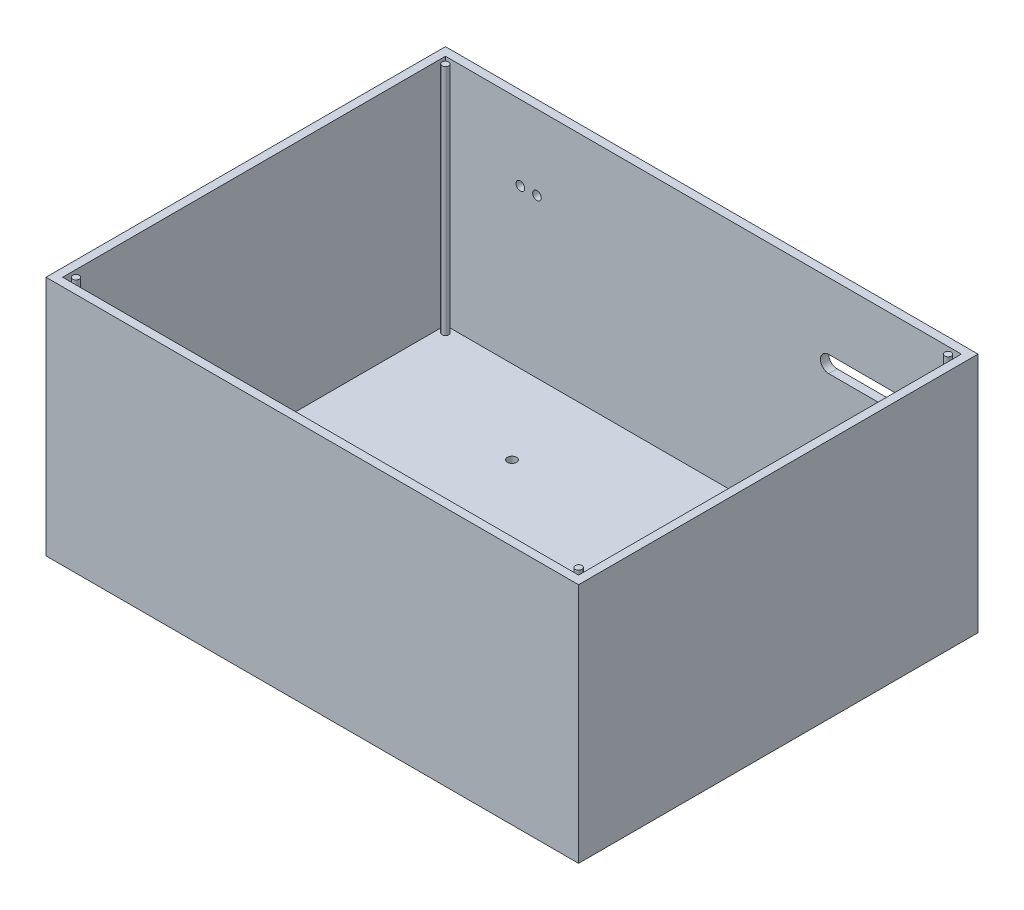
from build123d import *

# Parameters (mm, degrees)
SKETCH1_W               = 203.2
SKETCH1_H               = 152.4
BOSS_EXTRUDE2_DEPTH     = 3.175
SKETCH2_W               = 203.2
SKETCH2_H               = 152.4
SKETCH2_W_2             = 196.85
SKETCH2_H_2             = 146.05
BOSS_EXTRUDE3_DEPTH     = 88.9
CUT_EXTRUDE1_DEPTH      = 270.108175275
CUT_EXTRUDE1_DEPTH_BACK = 270.108175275
SKETCH3_R               = 1.7145
CUT_EXTRUDE2_REACH      = 272.174
SKETCH4_R               = 1.651
SKETCH5_R               = 1.27
BOSS_EXTRUDE4_DEPTH     = 88.9


with BuildPart() as part:
    # Sketch1 → Boss-Extrude2 (new body)
    with BuildSketch(Plane(origin=(0, 0, 0), x_dir=(1, 0, 0), z_dir=(0, 1, 0))):
        with Locations((101.6, 76.2)):
            Rectangle(SKETCH1_W, SKETCH1_H)
    extrude(amount=BOSS_EXTRUDE2_DEPTH)

    # Sketch2 → Boss-Extrude3 (add)
    with BuildSketch(Plane(origin=(0, 3.175, 0), x_dir=(1, 0, 0), z_dir=(0, 1, 0))):
        with Locations((101.6, 76.2)):
            Rectangle(SKETCH2_W, SKETCH2_H)
        with Locations((101.6, 76.2)):
            Rectangle(SKETCH2_W_2, SKETCH2_H_2, mode=Mode.SUBTRACT)
    extrude(amount=BOSS_EXTRUDE3_DEPTH)

    # Sketch3 → Cut-Extrude1 (cut, two sides: drawn at the far end of the back side and taken through both)
    with BuildSketch(Plane(origin=(0, 3.175, 0), x_dir=(1, 0, 0), z_dir=(0, 1, 0)).offset(-CUT_EXTRUDE1_DEPTH_BACK)):
        with Locations(Location((60.325, 117.475, 0), (0, 0, 270))):
            Circle(SKETCH3_R)
        with Locations(Location((123.825, 117.475, 0), (0, 0, 270))):
            Circle(SKETCH3_R)
        with Locations(Location((60.325, 47.625, 0), (0, 0, 270))):
            Circle(SKETCH3_R)
        with Locations(Location((123.825, 47.625, 0), (0, 0, 270))):
            Circle(SKETCH3_R)
    extrude(amount=CUT_EXTRUDE1_DEPTH + CUT_EXTRUDE1_DEPTH_BACK, mode=Mode.SUBTRACT)

    # Sketch4 → Cut-Extrude2 (cut, up to next)
    with BuildSketch(Plane(origin=(0, 0, -152.4), x_dir=(-1, 0, 0), z_dir=(0, 0, -1)), mode=Mode.PRIVATE) as cut_extrude2_sk1:
        with Locations((-38.1, 63.5)):
            Circle(SKETCH4_R)
    cut_extrude2_tool1 = extrude(cut_extrude2_sk1.sketch, amount=-CUT_EXTRUDE2_REACH, mode=Mode.PRIVATE) & part.part
    # Sketch4 → Cut-Extrude2 (cut, up to next)
    with BuildSketch(Plane(origin=(0, 0, -152.4), x_dir=(-1, 0, 0), z_dir=(0, 0, -1)), mode=Mode.PRIVATE) as cut_extrude2_sk2:
        with Locations((-31.75, 63.5)):
            Circle(SKETCH4_R)
    cut_extrude2_tool2 = extrude(cut_extrude2_sk2.sketch, amount=-CUT_EXTRUDE2_REACH, mode=Mode.PRIVATE) & part.part
    # Sketch4 → Cut-Extrude2 (cut, up to next)
    with BuildSketch(Plane(origin=(0, 0, -152.4), x_dir=(-1, 0, 0), z_dir=(0, 0, -1)), mode=Mode.PRIVATE) as cut_extrude2_sk3:
        with BuildLine():
            Line((-174.625, 60.325), (-149.422369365, 60.325))
            ThreePointArc((-149.422369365, 60.325), (-146.247369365, 63.5), (-149.422369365, 66.675))
            Line((-149.422369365, 66.675), (-174.625, 66.675))
            ThreePointArc((-174.625, 66.675), (-177.8, 63.5), (-174.625, 60.325))
        make_face()
    cut_extrude2_tool3 = extrude(cut_extrude2_sk3.sketch, amount=-CUT_EXTRUDE2_REACH, mode=Mode.PRIVATE) & part.part
    add(cut_extrude2_tool1.solids().sort_by_distance((38.1, 63.5, -152.4))[0], mode=Mode.SUBTRACT)
    add(cut_extrude2_tool2.solids().sort_by_distance((31.75, 63.5, -152.4))[0], mode=Mode.SUBTRACT)
    add(cut_extrude2_tool3.solids().sort_by_distance((162.023685, 63.5, -152.4))[0], mode=Mode.SUBTRACT)

    # Sketch5 → Boss-Extrude4 (add)
    with BuildSketch(Plane(origin=(0, 3.175, 0), x_dir=(1, 0, 0), z_dir=(0, 1, 0))):
        with Locations(Location((5.715, 5.715, 0), (0, 0, 90))):
            Circle(SKETCH5_R)
        with Locations(Location((5.715, 146.685, 0), (0, 0, 90))):
            Circle(SKETCH5_R)
        with Locations(Location((197.485, 5.715, 0), (0, 0, 90))):
            Circle(SKETCH5_R)
        with Locations(Location((197.485, 146.685, 0), (0, 0, 90))):
            Circle(SKETCH5_R)
    extrude(amount=BOSS_EXTRUDE4_DEPTH)


solid = part.part
